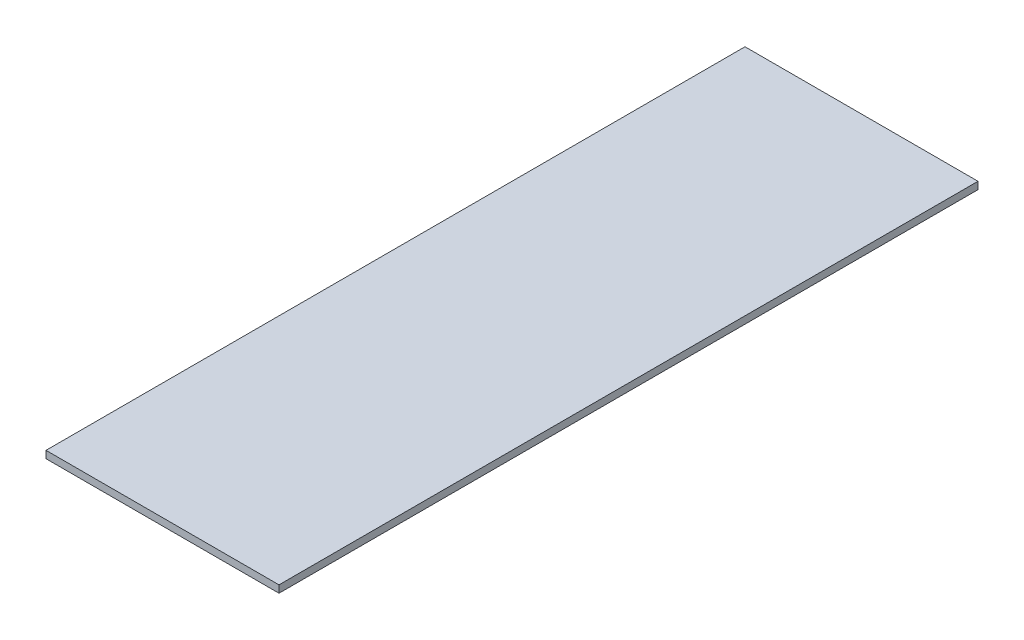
from build123d import *

# Parameters (mm, degrees)
SKETCH1_W           = 152.4
SKETCH1_H           = 457.2
BOSS_EXTRUDE1_DEPTH = 4.7625


with BuildPart() as part:
    # Sketch1 → Boss-Extrude1 (new body)
    with BuildSketch(Plane(origin=(0, 0, 0), x_dir=(1, 0, 0), z_dir=(0, 1, 0))):
        Rectangle(SKETCH1_W, SKETCH1_H)
    extrude(amount=BOSS_EXTRUDE1_DEPTH)


solid = part.part
